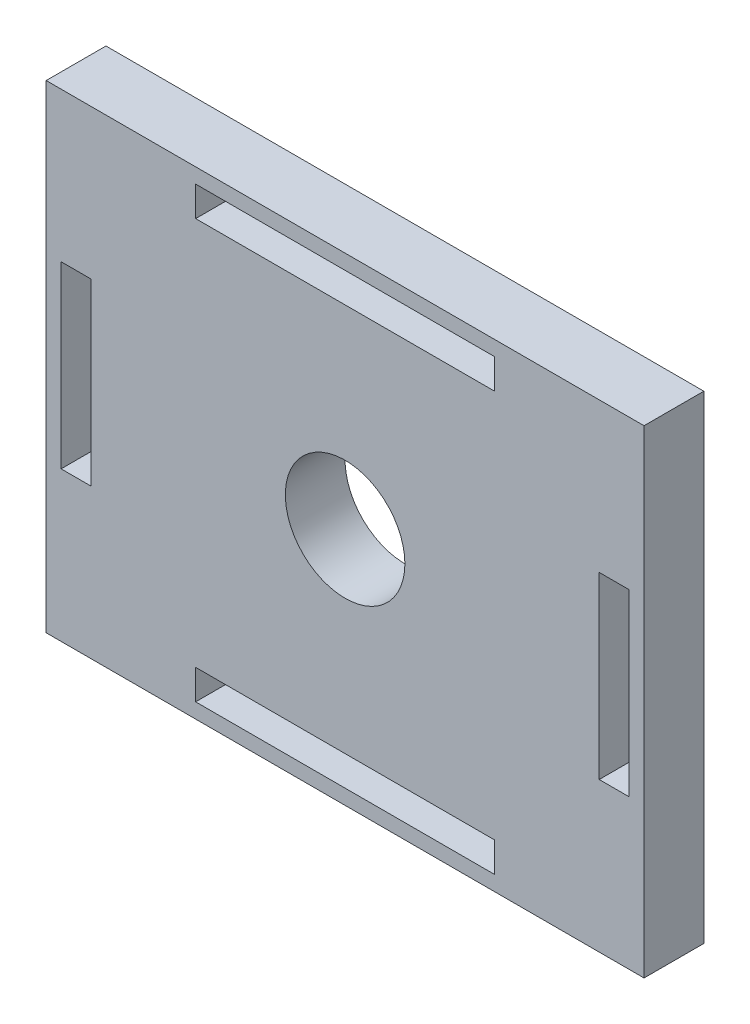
ISO-10303-21;
HEADER;
FILE_DESCRIPTION(('STEP AP214'),'2;1');
FILE_NAME('part.step','',(''),(''),'','','');
FILE_SCHEMA(('AUTOMOTIVE_DESIGN { 1 0 10303 214 1 1 1 1 }'));
ENDSEC;
DATA;
#1=APPLICATION_CONTEXT('core data for automotive mechanical design processes');
#2=APPLICATION_PROTOCOL_DEFINITION('international standard','automotive_design',2000,#1);
#3=PRODUCT_CONTEXT('',#1,'mechanical');
#4=PRODUCT('Part','Part','',(#3));
#5=PRODUCT_RELATED_PRODUCT_CATEGORY('part','',(#4));
#6=PRODUCT_DEFINITION_FORMATION('','',#4);
#7=PRODUCT_DEFINITION_CONTEXT('part definition',#1,'design');
#8=PRODUCT_DEFINITION('design','',#6,#7);
#9=PRODUCT_DEFINITION_SHAPE('','',#8);
#10=(LENGTH_UNIT() NAMED_UNIT(*) SI_UNIT(.MILLI.,.METRE.));
#11=(NAMED_UNIT(*) PLANE_ANGLE_UNIT() SI_UNIT($,.RADIAN.));
#12=(NAMED_UNIT(*) SI_UNIT($,.STERADIAN.) SOLID_ANGLE_UNIT());
#13=UNCERTAINTY_MEASURE_WITH_UNIT(LENGTH_MEASURE(1.E-05),#10,'distance_accuracy_value','');
#14=(GEOMETRIC_REPRESENTATION_CONTEXT(3) GLOBAL_UNCERTAINTY_ASSIGNED_CONTEXT((#13)) GLOBAL_UNIT_ASSIGNED_CONTEXT((#10,
#11,#12)) REPRESENTATION_CONTEXT('',''));
#15=CARTESIAN_POINT('',(0.,0.,0.));
#16=DIRECTION('',(0.,0.,1.));
#17=DIRECTION('',(1.,0.,0.));
#18=AXIS2_PLACEMENT_3D('',#15,#16,#17);
#19=CARTESIAN_POINT('',(0.,0.,10.));
#20=DIRECTION('',(0.,0.,-1.));
#21=DIRECTION('',(-1.,0.,0.));
#22=AXIS2_PLACEMENT_3D('',#19,#20,#21);
#23=PLANE('',#22);
#24=DIRECTION('',(0.,1.,0.));
#25=VECTOR('',#24,1.);
#26=CARTESIAN_POINT('',(-42.5,-15.,10.));
#27=LINE('',#26,#25);
#28=CARTESIAN_POINT('',(-42.5,-15.,10.));
#29=VERTEX_POINT('',#28);
#30=CARTESIAN_POINT('',(-42.5,15.,10.));
#31=VERTEX_POINT('',#30);
#32=EDGE_CURVE('E206',#29,#31,#27,.T.);
#33=ORIENTED_EDGE('',*,*,#32,.F.);
#34=DIRECTION('',(1.,0.,0.));
#35=VECTOR('',#34,1.);
#36=CARTESIAN_POINT('',(-47.5,-15.,10.));
#37=LINE('',#36,#35);
#38=CARTESIAN_POINT('',(-47.5,-15.,10.));
#39=VERTEX_POINT('',#38);
#40=EDGE_CURVE('E214',#39,#29,#37,.T.);
#41=ORIENTED_EDGE('',*,*,#40,.F.);
#42=DIRECTION('',(0.,-1.,0.));
#43=VECTOR('',#42,1.);
#44=CARTESIAN_POINT('',(-47.5,-15.,10.));
#45=LINE('',#44,#43);
#46=CARTESIAN_POINT('',(-47.5,15.,10.));
#47=VERTEX_POINT('',#46);
#48=EDGE_CURVE('E211',#47,#39,#45,.T.);
#49=ORIENTED_EDGE('',*,*,#48,.F.);
#50=DIRECTION('',(-1.,0.,0.));
#51=VECTOR('',#50,1.);
#52=CARTESIAN_POINT('',(-47.5,15.,10.));
#53=LINE('',#52,#51);
#54=EDGE_CURVE('E208',#31,#47,#53,.T.);
#55=ORIENTED_EDGE('',*,*,#54,.F.);
#56=EDGE_LOOP('',(#33,#41,#49,#55));
#57=FACE_BOUND('',#56,.T.);
#58=DIRECTION('',(0.,1.,0.));
#59=VECTOR('',#58,1.);
#60=CARTESIAN_POINT('',(25.,32.5,10.));
#61=LINE('',#60,#59);
#62=CARTESIAN_POINT('',(25.,32.5,10.));
#63=VERTEX_POINT('',#62);
#64=CARTESIAN_POINT('',(25.,37.5,10.));
#65=VERTEX_POINT('',#64);
#66=EDGE_CURVE('E274',#63,#65,#61,.T.);
#67=ORIENTED_EDGE('',*,*,#66,.F.);
#68=DIRECTION('',(1.,0.,0.));
#69=VECTOR('',#68,1.);
#70=CARTESIAN_POINT('',(-25.,32.5,10.));
#71=LINE('',#70,#69);
#72=CARTESIAN_POINT('',(-25.,32.5,10.));
#73=VERTEX_POINT('',#72);
#74=EDGE_CURVE('E282',#73,#63,#71,.T.);
#75=ORIENTED_EDGE('',*,*,#74,.F.);
#76=DIRECTION('',(0.,-1.,0.));
#77=VECTOR('',#76,1.);
#78=CARTESIAN_POINT('',(-25.,32.5,10.));
#79=LINE('',#78,#77);
#80=CARTESIAN_POINT('',(-25.,37.5,10.));
#81=VERTEX_POINT('',#80);
#82=EDGE_CURVE('E279',#81,#73,#79,.T.);
#83=ORIENTED_EDGE('',*,*,#82,.F.);
#84=DIRECTION('',(-1.,0.,0.));
#85=VECTOR('',#84,1.);
#86=CARTESIAN_POINT('',(-25.,37.5,10.));
#87=LINE('',#86,#85);
#88=EDGE_CURVE('E276',#65,#81,#87,.T.);
#89=ORIENTED_EDGE('',*,*,#88,.F.);
#90=EDGE_LOOP('',(#67,#75,#83,#89));
#91=FACE_BOUND('',#90,.T.);
#92=DIRECTION('',(0.,1.,0.));
#93=VECTOR('',#92,1.);
#94=CARTESIAN_POINT('',(50.,-40.,10.));
#95=LINE('',#94,#93);
#96=CARTESIAN_POINT('',(50.,-40.,10.));
#97=VERTEX_POINT('',#96);
#98=CARTESIAN_POINT('',(50.,40.,10.));
#99=VERTEX_POINT('',#98);
#100=EDGE_CURVE('E305',#97,#99,#95,.T.);
#101=ORIENTED_EDGE('',*,*,#100,.T.);
#102=DIRECTION('',(-1.,0.,0.));
#103=VECTOR('',#102,1.);
#104=CARTESIAN_POINT('',(-50.,40.,10.));
#105=LINE('',#104,#103);
#106=CARTESIAN_POINT('',(-50.,40.,10.));
#107=VERTEX_POINT('',#106);
#108=EDGE_CURVE('E308',#99,#107,#105,.T.);
#109=ORIENTED_EDGE('',*,*,#108,.T.);
#110=DIRECTION('',(0.,-1.,0.));
#111=VECTOR('',#110,1.);
#112=CARTESIAN_POINT('',(-50.,-40.,10.));
#113=LINE('',#112,#111);
#114=CARTESIAN_POINT('',(-50.,-40.,10.));
#115=VERTEX_POINT('',#114);
#116=EDGE_CURVE('E311',#107,#115,#113,.T.);
#117=ORIENTED_EDGE('',*,*,#116,.T.);
#118=DIRECTION('',(1.,0.,0.));
#119=VECTOR('',#118,1.);
#120=CARTESIAN_POINT('',(-50.,-40.,10.));
#121=LINE('',#120,#119);
#122=EDGE_CURVE('E313',#115,#97,#121,.T.);
#123=ORIENTED_EDGE('',*,*,#122,.T.);
#124=EDGE_LOOP('',(#101,#109,#117,#123));
#125=FACE_BOUND('',#124,.T.);
#126=DIRECTION('',(-1.,0.,0.));
#127=VECTOR('',#126,1.);
#128=CARTESIAN_POINT('',(-25.,-32.5,10.));
#129=LINE('',#128,#127);
#130=CARTESIAN_POINT('',(25.,-32.5,10.));
#131=VERTEX_POINT('',#130);
#132=CARTESIAN_POINT('',(-25.,-32.5,10.));
#133=VERTEX_POINT('',#132);
#134=EDGE_CURVE('E243',#131,#133,#129,.T.);
#135=ORIENTED_EDGE('',*,*,#134,.F.);
#136=DIRECTION('',(0.,1.,0.));
#137=VECTOR('',#136,1.);
#138=CARTESIAN_POINT('',(25.,-32.5,10.));
#139=LINE('',#138,#137);
#140=CARTESIAN_POINT('',(25.,-37.5,10.));
#141=VERTEX_POINT('',#140);
#142=EDGE_CURVE('E251',#141,#131,#139,.T.);
#143=ORIENTED_EDGE('',*,*,#142,.F.);
#144=DIRECTION('',(1.,0.,0.));
#145=VECTOR('',#144,1.);
#146=CARTESIAN_POINT('',(-25.,-37.5,10.));
#147=LINE('',#146,#145);
#148=CARTESIAN_POINT('',(-25.,-37.5,10.));
#149=VERTEX_POINT('',#148);
#150=EDGE_CURVE('E248',#149,#141,#147,.T.);
#151=ORIENTED_EDGE('',*,*,#150,.F.);
#152=DIRECTION('',(0.,-1.,0.));
#153=VECTOR('',#152,1.);
#154=CARTESIAN_POINT('',(-25.,-32.5,10.));
#155=LINE('',#154,#153);
#156=EDGE_CURVE('E245',#133,#149,#155,.T.);
#157=ORIENTED_EDGE('',*,*,#156,.F.);
#158=EDGE_LOOP('',(#135,#143,#151,#157));
#159=FACE_BOUND('',#158,.T.);
#160=CARTESIAN_POINT('',(0.,0.,10.));
#161=DIRECTION('',(0.,0.,1.));
#162=DIRECTION('',(1.,0.,0.));
#163=AXIS2_PLACEMENT_3D('',#160,#161,#162);
#164=CIRCLE('',#163,10.);
#165=CARTESIAN_POINT('',(10.,0.,10.));
#166=VERTEX_POINT('',#165);
#167=EDGE_CURVE('E237',#166,#166,#164,.T.);
#168=ORIENTED_EDGE('',*,*,#167,.F.);
#169=EDGE_LOOP('',(#168));
#170=FACE_BOUND('',#169,.T.);
#171=DIRECTION('',(0.,1.,0.));
#172=VECTOR('',#171,1.);
#173=CARTESIAN_POINT('',(47.5,-15.,10.));
#174=LINE('',#173,#172);
#175=CARTESIAN_POINT('',(47.5,-15.,10.));
#176=VERTEX_POINT('',#175);
#177=CARTESIAN_POINT('',(47.5,15.,10.));
#178=VERTEX_POINT('',#177);
#179=EDGE_CURVE('E170',#176,#178,#174,.T.);
#180=ORIENTED_EDGE('',*,*,#179,.F.);
#181=DIRECTION('',(1.,0.,0.));
#182=VECTOR('',#181,1.);
#183=CARTESIAN_POINT('',(47.5,-15.,10.));
#184=LINE('',#183,#182);
#185=CARTESIAN_POINT('',(42.5,-15.,10.));
#186=VERTEX_POINT('',#185);
#187=EDGE_CURVE('E192',#186,#176,#184,.T.);
#188=ORIENTED_EDGE('',*,*,#187,.F.);
#189=DIRECTION('',(0.,-1.,0.));
#190=VECTOR('',#189,1.);
#191=CARTESIAN_POINT('',(42.5,-15.,10.));
#192=LINE('',#191,#190);
#193=CARTESIAN_POINT('',(42.5,15.,10.));
#194=VERTEX_POINT('',#193);
#195=EDGE_CURVE('E190',#194,#186,#192,.T.);
#196=ORIENTED_EDGE('',*,*,#195,.F.);
#197=DIRECTION('',(-1.,0.,0.));
#198=VECTOR('',#197,1.);
#199=CARTESIAN_POINT('',(47.5,15.,10.));
#200=LINE('',#199,#198);
#201=EDGE_CURVE('E178',#178,#194,#200,.T.);
#202=ORIENTED_EDGE('',*,*,#201,.F.);
#203=EDGE_LOOP('',(#180,#188,#196,#202));
#204=FACE_BOUND('',#203,.T.);
#205=ADVANCED_FACE('F33',(#57,#91,#125,#159,#170,#204),#23,.F.);
#206=CARTESIAN_POINT('',(0.,0.,0.));
#207=DIRECTION('',(0.,0.,-1.));
#208=DIRECTION('',(-1.,0.,0.));
#209=AXIS2_PLACEMENT_3D('',#206,#207,#208);
#210=PLANE('',#209);
#211=DIRECTION('',(0.,1.,0.));
#212=VECTOR('',#211,1.);
#213=CARTESIAN_POINT('',(25.,-32.5,0.));
#214=LINE('',#213,#212);
#215=CARTESIAN_POINT('',(25.,-37.5,0.));
#216=VERTEX_POINT('',#215);
#217=CARTESIAN_POINT('',(25.,-32.5,0.));
#218=VERTEX_POINT('',#217);
#219=EDGE_CURVE('E246',#216,#218,#214,.T.);
#220=ORIENTED_EDGE('',*,*,#219,.T.);
#221=DIRECTION('',(-1.,0.,0.));
#222=VECTOR('',#221,1.);
#223=CARTESIAN_POINT('',(-25.,-32.5,0.));
#224=LINE('',#223,#222);
#225=CARTESIAN_POINT('',(-25.,-32.5,0.));
#226=VERTEX_POINT('',#225);
#227=EDGE_CURVE('E240',#218,#226,#224,.T.);
#228=ORIENTED_EDGE('',*,*,#227,.T.);
#229=DIRECTION('',(0.,-1.,0.));
#230=VECTOR('',#229,1.);
#231=CARTESIAN_POINT('',(-25.,-32.5,0.));
#232=LINE('',#231,#230);
#233=CARTESIAN_POINT('',(-25.,-37.5,0.));
#234=VERTEX_POINT('',#233);
#235=EDGE_CURVE('E256',#226,#234,#232,.T.);
#236=ORIENTED_EDGE('',*,*,#235,.T.);
#237=DIRECTION('',(1.,0.,0.));
#238=VECTOR('',#237,1.);
#239=CARTESIAN_POINT('',(-25.,-37.5,0.));
#240=LINE('',#239,#238);
#241=EDGE_CURVE('E259',#234,#216,#240,.T.);
#242=ORIENTED_EDGE('',*,*,#241,.T.);
#243=EDGE_LOOP('',(#220,#228,#236,#242));
#244=FACE_BOUND('',#243,.T.);
#245=DIRECTION('',(1.,0.,0.));
#246=VECTOR('',#245,1.);
#247=CARTESIAN_POINT('',(-25.,32.5,0.));
#248=LINE('',#247,#246);
#249=CARTESIAN_POINT('',(-25.,32.5,0.));
#250=VERTEX_POINT('',#249);
#251=CARTESIAN_POINT('',(25.,32.5,0.));
#252=VERTEX_POINT('',#251);
#253=EDGE_CURVE('E277',#250,#252,#248,.T.);
#254=ORIENTED_EDGE('',*,*,#253,.T.);
#255=DIRECTION('',(0.,1.,0.));
#256=VECTOR('',#255,1.);
#257=CARTESIAN_POINT('',(25.,32.5,0.));
#258=LINE('',#257,#256);
#259=CARTESIAN_POINT('',(25.,37.5,0.));
#260=VERTEX_POINT('',#259);
#261=EDGE_CURVE('E273',#252,#260,#258,.T.);
#262=ORIENTED_EDGE('',*,*,#261,.T.);
#263=DIRECTION('',(-1.,0.,0.));
#264=VECTOR('',#263,1.);
#265=CARTESIAN_POINT('',(-25.,37.5,0.));
#266=LINE('',#265,#264);
#267=CARTESIAN_POINT('',(-25.,37.5,0.));
#268=VERTEX_POINT('',#267);
#269=EDGE_CURVE('E287',#260,#268,#266,.T.);
#270=ORIENTED_EDGE('',*,*,#269,.T.);
#271=DIRECTION('',(0.,-1.,0.));
#272=VECTOR('',#271,1.);
#273=CARTESIAN_POINT('',(-25.,32.5,0.));
#274=LINE('',#273,#272);
#275=EDGE_CURVE('E290',#268,#250,#274,.T.);
#276=ORIENTED_EDGE('',*,*,#275,.T.);
#277=EDGE_LOOP('',(#254,#262,#270,#276));
#278=FACE_BOUND('',#277,.T.);
#279=DIRECTION('',(0.,1.,0.));
#280=VECTOR('',#279,1.);
#281=CARTESIAN_POINT('',(50.,-40.,0.));
#282=LINE('',#281,#280);
#283=CARTESIAN_POINT('',(50.,-40.,0.));
#284=VERTEX_POINT('',#283);
#285=CARTESIAN_POINT('',(50.,40.,0.));
#286=VERTEX_POINT('',#285);
#287=EDGE_CURVE('E304',#284,#286,#282,.T.);
#288=ORIENTED_EDGE('',*,*,#287,.F.);
#289=DIRECTION('',(1.,0.,0.));
#290=VECTOR('',#289,1.);
#291=CARTESIAN_POINT('',(-50.,-40.,0.));
#292=LINE('',#291,#290);
#293=CARTESIAN_POINT('',(-50.,-40.,0.));
#294=VERTEX_POINT('',#293);
#295=EDGE_CURVE('E309',#294,#284,#292,.T.);
#296=ORIENTED_EDGE('',*,*,#295,.F.);
#297=DIRECTION('',(0.,-1.,0.));
#298=VECTOR('',#297,1.);
#299=CARTESIAN_POINT('',(-50.,-40.,0.));
#300=LINE('',#299,#298);
#301=CARTESIAN_POINT('',(-50.,40.,0.));
#302=VERTEX_POINT('',#301);
#303=EDGE_CURVE('E320',#302,#294,#300,.T.);
#304=ORIENTED_EDGE('',*,*,#303,.F.);
#305=DIRECTION('',(-1.,0.,0.));
#306=VECTOR('',#305,1.);
#307=CARTESIAN_POINT('',(-50.,40.,0.));
#308=LINE('',#307,#306);
#309=EDGE_CURVE('E318',#286,#302,#308,.T.);
#310=ORIENTED_EDGE('',*,*,#309,.F.);
#311=EDGE_LOOP('',(#288,#296,#304,#310));
#312=FACE_BOUND('',#311,.T.);
#313=CARTESIAN_POINT('',(0.,0.,0.));
#314=DIRECTION('',(0.,0.,1.));
#315=DIRECTION('',(1.,0.,0.));
#316=AXIS2_PLACEMENT_3D('',#313,#314,#315);
#317=CIRCLE('',#316,10.);
#318=CARTESIAN_POINT('',(10.,0.,0.));
#319=VERTEX_POINT('',#318);
#320=EDGE_CURVE('E236',#319,#319,#317,.T.);
#321=ORIENTED_EDGE('',*,*,#320,.T.);
#322=EDGE_LOOP('',(#321));
#323=FACE_BOUND('',#322,.T.);
#324=DIRECTION('',(1.,0.,0.));
#325=VECTOR('',#324,1.);
#326=CARTESIAN_POINT('',(-47.5,-15.,0.));
#327=LINE('',#326,#325);
#328=CARTESIAN_POINT('',(-47.5,-15.,0.));
#329=VERTEX_POINT('',#328);
#330=CARTESIAN_POINT('',(-42.5,-15.,0.));
#331=VERTEX_POINT('',#330);
#332=EDGE_CURVE('E209',#329,#331,#327,.T.);
#333=ORIENTED_EDGE('',*,*,#332,.T.);
#334=DIRECTION('',(0.,1.,0.));
#335=VECTOR('',#334,1.);
#336=CARTESIAN_POINT('',(-42.5,-15.,0.));
#337=LINE('',#336,#335);
#338=CARTESIAN_POINT('',(-42.5,15.,0.));
#339=VERTEX_POINT('',#338);
#340=EDGE_CURVE('E186',#331,#339,#337,.T.);
#341=ORIENTED_EDGE('',*,*,#340,.T.);
#342=DIRECTION('',(-1.,0.,0.));
#343=VECTOR('',#342,1.);
#344=CARTESIAN_POINT('',(-47.5,15.,0.));
#345=LINE('',#344,#343);
#346=CARTESIAN_POINT('',(-47.5,15.,0.));
#347=VERTEX_POINT('',#346);
#348=EDGE_CURVE('E219',#339,#347,#345,.T.);
#349=ORIENTED_EDGE('',*,*,#348,.T.);
#350=DIRECTION('',(0.,-1.,0.));
#351=VECTOR('',#350,1.);
#352=CARTESIAN_POINT('',(-47.5,-15.,0.));
#353=LINE('',#352,#351);
#354=EDGE_CURVE('E222',#347,#329,#353,.T.);
#355=ORIENTED_EDGE('',*,*,#354,.T.);
#356=EDGE_LOOP('',(#333,#341,#349,#355));
#357=FACE_BOUND('',#356,.T.);
#358=DIRECTION('',(1.,0.,0.));
#359=VECTOR('',#358,1.);
#360=CARTESIAN_POINT('',(47.5,-15.,0.));
#361=LINE('',#360,#359);
#362=CARTESIAN_POINT('',(42.5,-15.,0.));
#363=VERTEX_POINT('',#362);
#364=CARTESIAN_POINT('',(47.5,-15.,0.));
#365=VERTEX_POINT('',#364);
#366=EDGE_CURVE('E179',#363,#365,#361,.T.);
#367=ORIENTED_EDGE('',*,*,#366,.T.);
#368=DIRECTION('',(0.,1.,0.));
#369=VECTOR('',#368,1.);
#370=CARTESIAN_POINT('',(47.5,-15.,0.));
#371=LINE('',#370,#369);
#372=CARTESIAN_POINT('',(47.5,15.,0.));
#373=VERTEX_POINT('',#372);
#374=EDGE_CURVE('E56',#365,#373,#371,.T.);
#375=ORIENTED_EDGE('',*,*,#374,.T.);
#376=DIRECTION('',(-1.,0.,0.));
#377=VECTOR('',#376,1.);
#378=CARTESIAN_POINT('',(47.5,15.,0.));
#379=LINE('',#378,#377);
#380=CARTESIAN_POINT('',(42.5,15.,0.));
#381=VERTEX_POINT('',#380);
#382=EDGE_CURVE('E185',#373,#381,#379,.T.);
#383=ORIENTED_EDGE('',*,*,#382,.T.);
#384=DIRECTION('',(0.,-1.,0.));
#385=VECTOR('',#384,1.);
#386=CARTESIAN_POINT('',(42.5,-15.,0.));
#387=LINE('',#386,#385);
#388=EDGE_CURVE('E198',#381,#363,#387,.T.);
#389=ORIENTED_EDGE('',*,*,#388,.T.);
#390=EDGE_LOOP('',(#367,#375,#383,#389));
#391=FACE_BOUND('',#390,.T.);
#392=ADVANCED_FACE('F338',(#244,#278,#312,#323,#357,#391),#210,.T.);
#393=CARTESIAN_POINT('',(50.,-40.,10.));
#394=DIRECTION('',(-1.,0.,0.));
#395=DIRECTION('',(0.,0.,1.));
#396=AXIS2_PLACEMENT_3D('',#393,#394,#395);
#397=PLANE('',#396);
#398=ORIENTED_EDGE('',*,*,#287,.T.);
#399=DIRECTION('',(0.,0.,-1.));
#400=VECTOR('',#399,1.);
#401=CARTESIAN_POINT('',(50.,40.,10.));
#402=LINE('',#401,#400);
#403=EDGE_CURVE('E11',#99,#286,#402,.T.);
#404=ORIENTED_EDGE('',*,*,#403,.F.);
#405=ORIENTED_EDGE('',*,*,#100,.F.);
#406=DIRECTION('',(0.,0.,-1.));
#407=VECTOR('',#406,1.);
#408=CARTESIAN_POINT('',(50.,-40.,10.));
#409=LINE('',#408,#407);
#410=EDGE_CURVE('E315',#97,#284,#409,.T.);
#411=ORIENTED_EDGE('',*,*,#410,.T.);
#412=EDGE_LOOP('',(#398,#404,#405,#411));
#413=FACE_BOUND('',#412,.T.);
#414=ADVANCED_FACE('F35',(#413),#397,.F.);
#415=CARTESIAN_POINT('',(-50.,40.,10.));
#416=DIRECTION('',(0.,-1.,0.));
#417=DIRECTION('',(0.,0.,-1.));
#418=AXIS2_PLACEMENT_3D('',#415,#416,#417);
#419=PLANE('',#418);
#420=ORIENTED_EDGE('',*,*,#309,.T.);
#421=DIRECTION('',(0.,0.,-1.));
#422=VECTOR('',#421,1.);
#423=CARTESIAN_POINT('',(-50.,40.,10.));
#424=LINE('',#423,#422);
#425=EDGE_CURVE('E41',#107,#302,#424,.T.);
#426=ORIENTED_EDGE('',*,*,#425,.F.);
#427=ORIENTED_EDGE('',*,*,#108,.F.);
#428=ORIENTED_EDGE('',*,*,#403,.T.);
#429=EDGE_LOOP('',(#420,#426,#427,#428));
#430=FACE_BOUND('',#429,.T.);
#431=ADVANCED_FACE('F349',(#430),#419,.F.);
#432=CARTESIAN_POINT('',(-50.,-40.,10.));
#433=DIRECTION('',(1.,0.,0.));
#434=DIRECTION('',(0.,0.,-1.));
#435=AXIS2_PLACEMENT_3D('',#432,#433,#434);
#436=PLANE('',#435);
#437=ORIENTED_EDGE('',*,*,#303,.T.);
#438=DIRECTION('',(0.,0.,-1.));
#439=VECTOR('',#438,1.);
#440=CARTESIAN_POINT('',(-50.,-40.,10.));
#441=LINE('',#440,#439);
#442=EDGE_CURVE('E325',#115,#294,#441,.T.);
#443=ORIENTED_EDGE('',*,*,#442,.F.);
#444=ORIENTED_EDGE('',*,*,#116,.F.);
#445=ORIENTED_EDGE('',*,*,#425,.T.);
#446=EDGE_LOOP('',(#437,#443,#444,#445));
#447=FACE_BOUND('',#446,.T.);
#448=ADVANCED_FACE('F332',(#447),#436,.F.);
#449=CARTESIAN_POINT('',(-50.,-40.,10.));
#450=DIRECTION('',(0.,1.,0.));
#451=DIRECTION('',(0.,0.,1.));
#452=AXIS2_PLACEMENT_3D('',#449,#450,#451);
#453=PLANE('',#452);
#454=ORIENTED_EDGE('',*,*,#295,.T.);
#455=ORIENTED_EDGE('',*,*,#410,.F.);
#456=ORIENTED_EDGE('',*,*,#122,.F.);
#457=ORIENTED_EDGE('',*,*,#442,.T.);
#458=EDGE_LOOP('',(#454,#455,#456,#457));
#459=FACE_BOUND('',#458,.T.);
#460=ADVANCED_FACE('F342',(#459),#453,.F.);
#461=CARTESIAN_POINT('',(25.,32.5,10.));
#462=DIRECTION('',(-1.,0.,0.));
#463=DIRECTION('',(0.,-1.,0.));
#464=AXIS2_PLACEMENT_3D('',#461,#462,#463);
#465=PLANE('',#464);
#466=ORIENTED_EDGE('',*,*,#261,.F.);
#467=DIRECTION('',(0.,0.,-1.));
#468=VECTOR('',#467,1.);
#469=CARTESIAN_POINT('',(25.,32.5,10.));
#470=LINE('',#469,#468);
#471=EDGE_CURVE('E284',#63,#252,#470,.T.);
#472=ORIENTED_EDGE('',*,*,#471,.F.);
#473=ORIENTED_EDGE('',*,*,#66,.T.);
#474=DIRECTION('',(0.,0.,-1.));
#475=VECTOR('',#474,1.);
#476=CARTESIAN_POINT('',(25.,37.5,10.));
#477=LINE('',#476,#475);
#478=EDGE_CURVE('E301',#65,#260,#477,.T.);
#479=ORIENTED_EDGE('',*,*,#478,.T.);
#480=EDGE_LOOP('',(#466,#472,#473,#479));
#481=FACE_BOUND('',#480,.T.);
#482=ADVANCED_FACE('F367',(#481),#465,.T.);
#483=CARTESIAN_POINT('',(-25.,37.5,10.));
#484=DIRECTION('',(0.,-1.,0.));
#485=DIRECTION('',(1.,0.,0.));
#486=AXIS2_PLACEMENT_3D('',#483,#484,#485);
#487=PLANE('',#486);
#488=ORIENTED_EDGE('',*,*,#269,.F.);
#489=ORIENTED_EDGE('',*,*,#478,.F.);
#490=ORIENTED_EDGE('',*,*,#88,.T.);
#491=DIRECTION('',(0.,0.,-1.));
#492=VECTOR('',#491,1.);
#493=CARTESIAN_POINT('',(-25.,37.5,10.));
#494=LINE('',#493,#492);
#495=EDGE_CURVE('E299',#81,#268,#494,.T.);
#496=ORIENTED_EDGE('',*,*,#495,.T.);
#497=EDGE_LOOP('',(#488,#489,#490,#496));
#498=FACE_BOUND('',#497,.T.);
#499=ADVANCED_FACE('F374',(#498),#487,.T.);
#500=CARTESIAN_POINT('',(-25.,32.5,10.));
#501=DIRECTION('',(1.,0.,0.));
#502=DIRECTION('',(0.,0.,-1.));
#503=AXIS2_PLACEMENT_3D('',#500,#501,#502);
#504=PLANE('',#503);
#505=ORIENTED_EDGE('',*,*,#275,.F.);
#506=ORIENTED_EDGE('',*,*,#495,.F.);
#507=ORIENTED_EDGE('',*,*,#82,.T.);
#508=DIRECTION('',(0.,0.,-1.));
#509=VECTOR('',#508,1.);
#510=CARTESIAN_POINT('',(-25.,32.5,10.));
#511=LINE('',#510,#509);
#512=EDGE_CURVE('E297',#73,#250,#511,.T.);
#513=ORIENTED_EDGE('',*,*,#512,.T.);
#514=EDGE_LOOP('',(#505,#506,#507,#513));
#515=FACE_BOUND('',#514,.T.);
#516=ADVANCED_FACE('F379',(#515),#504,.T.);
#517=CARTESIAN_POINT('',(-25.,32.5,10.));
#518=DIRECTION('',(0.,1.,0.));
#519=DIRECTION('',(-1.,0.,0.));
#520=AXIS2_PLACEMENT_3D('',#517,#518,#519);
#521=PLANE('',#520);
#522=ORIENTED_EDGE('',*,*,#253,.F.);
#523=ORIENTED_EDGE('',*,*,#512,.F.);
#524=ORIENTED_EDGE('',*,*,#74,.T.);
#525=ORIENTED_EDGE('',*,*,#471,.T.);
#526=EDGE_LOOP('',(#522,#523,#524,#525));
#527=FACE_BOUND('',#526,.T.);
#528=ADVANCED_FACE('F387',(#527),#521,.T.);
#529=CARTESIAN_POINT('',(-25.,-32.5,10.));
#530=DIRECTION('',(0.,-1.,0.));
#531=DIRECTION('',(1.,0.,0.));
#532=AXIS2_PLACEMENT_3D('',#529,#530,#531);
#533=PLANE('',#532);
#534=ORIENTED_EDGE('',*,*,#227,.F.);
#535=DIRECTION('',(0.,0.,-1.));
#536=VECTOR('',#535,1.);
#537=CARTESIAN_POINT('',(25.,-32.5,10.));
#538=LINE('',#537,#536);
#539=EDGE_CURVE('E253',#131,#218,#538,.T.);
#540=ORIENTED_EDGE('',*,*,#539,.F.);
#541=ORIENTED_EDGE('',*,*,#134,.T.);
#542=DIRECTION('',(0.,0.,-1.));
#543=VECTOR('',#542,1.);
#544=CARTESIAN_POINT('',(-25.,-32.5,10.));
#545=LINE('',#544,#543);
#546=EDGE_CURVE('E270',#133,#226,#545,.T.);
#547=ORIENTED_EDGE('',*,*,#546,.T.);
#548=EDGE_LOOP('',(#534,#540,#541,#547));
#549=FACE_BOUND('',#548,.T.);
#550=ADVANCED_FACE('F399',(#549),#533,.T.);
#551=CARTESIAN_POINT('',(-25.,-32.5,10.));
#552=DIRECTION('',(1.,0.,0.));
#553=DIRECTION('',(0.,0.,-1.));
#554=AXIS2_PLACEMENT_3D('',#551,#552,#553);
#555=PLANE('',#554);
#556=ORIENTED_EDGE('',*,*,#235,.F.);
#557=ORIENTED_EDGE('',*,*,#546,.F.);
#558=ORIENTED_EDGE('',*,*,#156,.T.);
#559=DIRECTION('',(0.,0.,-1.));
#560=VECTOR('',#559,1.);
#561=CARTESIAN_POINT('',(-25.,-37.5,10.));
#562=LINE('',#561,#560);
#563=EDGE_CURVE('E268',#149,#234,#562,.T.);
#564=ORIENTED_EDGE('',*,*,#563,.T.);
#565=EDGE_LOOP('',(#556,#557,#558,#564));
#566=FACE_BOUND('',#565,.T.);
#567=ADVANCED_FACE('F404',(#566),#555,.T.);
#568=CARTESIAN_POINT('',(-25.,-37.5,10.));
#569=DIRECTION('',(0.,1.,0.));
#570=DIRECTION('',(-1.,0.,0.));
#571=AXIS2_PLACEMENT_3D('',#568,#569,#570);
#572=PLANE('',#571);
#573=ORIENTED_EDGE('',*,*,#241,.F.);
#574=ORIENTED_EDGE('',*,*,#563,.F.);
#575=ORIENTED_EDGE('',*,*,#150,.T.);
#576=DIRECTION('',(0.,0.,-1.));
#577=VECTOR('',#576,1.);
#578=CARTESIAN_POINT('',(25.,-37.5,10.));
#579=LINE('',#578,#577);
#580=EDGE_CURVE('E266',#141,#216,#579,.T.);
#581=ORIENTED_EDGE('',*,*,#580,.T.);
#582=EDGE_LOOP('',(#573,#574,#575,#581));
#583=FACE_BOUND('',#582,.T.);
#584=ADVANCED_FACE('F408',(#583),#572,.T.);
#585=CARTESIAN_POINT('',(25.,-32.5,10.));
#586=DIRECTION('',(-1.,0.,0.));
#587=DIRECTION('',(0.,-1.,0.));
#588=AXIS2_PLACEMENT_3D('',#585,#586,#587);
#589=PLANE('',#588);
#590=ORIENTED_EDGE('',*,*,#219,.F.);
#591=ORIENTED_EDGE('',*,*,#580,.F.);
#592=ORIENTED_EDGE('',*,*,#142,.T.);
#593=ORIENTED_EDGE('',*,*,#539,.T.);
#594=EDGE_LOOP('',(#590,#591,#592,#593));
#595=FACE_BOUND('',#594,.T.);
#596=ADVANCED_FACE('F412',(#595),#589,.T.);
#597=CARTESIAN_POINT('',(0.,0.,10.));
#598=DIRECTION('',(0.,0.,-1.));
#599=DIRECTION('',(-1.,0.,0.));
#600=AXIS2_PLACEMENT_3D('',#597,#598,#599);
#601=CYLINDRICAL_SURFACE('',#600,10.);
#602=ORIENTED_EDGE('',*,*,#167,.T.);
#603=EDGE_LOOP('',(#602));
#604=FACE_BOUND('',#603,.T.);
#605=ORIENTED_EDGE('',*,*,#320,.F.);
#606=EDGE_LOOP('',(#605));
#607=FACE_BOUND('',#606,.T.);
#608=ADVANCED_FACE('F416',(#604,#607),#601,.F.);
#609=CARTESIAN_POINT('',(-42.5,-15.,10.));
#610=DIRECTION('',(-1.,0.,0.));
#611=DIRECTION('',(0.,0.,1.));
#612=AXIS2_PLACEMENT_3D('',#609,#610,#611);
#613=PLANE('',#612);
#614=ORIENTED_EDGE('',*,*,#340,.F.);
#615=DIRECTION('',(0.,0.,-1.));
#616=VECTOR('',#615,1.);
#617=CARTESIAN_POINT('',(-42.5,-15.,10.));
#618=LINE('',#617,#616);
#619=EDGE_CURVE('E216',#29,#331,#618,.T.);
#620=ORIENTED_EDGE('',*,*,#619,.F.);
#621=ORIENTED_EDGE('',*,*,#32,.T.);
#622=DIRECTION('',(0.,0.,-1.));
#623=VECTOR('',#622,1.);
#624=CARTESIAN_POINT('',(-42.5,15.,10.));
#625=LINE('',#624,#623);
#626=EDGE_CURVE('E233',#31,#339,#625,.T.);
#627=ORIENTED_EDGE('',*,*,#626,.T.);
#628=EDGE_LOOP('',(#614,#620,#621,#627));
#629=FACE_BOUND('',#628,.T.);
#630=ADVANCED_FACE('F420',(#629),#613,.T.);
#631=CARTESIAN_POINT('',(-47.5,15.,10.));
#632=DIRECTION('',(0.,-1.,0.));
#633=DIRECTION('',(0.,0.,-1.));
#634=AXIS2_PLACEMENT_3D('',#631,#632,#633);
#635=PLANE('',#634);
#636=ORIENTED_EDGE('',*,*,#348,.F.);
#637=ORIENTED_EDGE('',*,*,#626,.F.);
#638=ORIENTED_EDGE('',*,*,#54,.T.);
#639=DIRECTION('',(0.,0.,-1.));
#640=VECTOR('',#639,1.);
#641=CARTESIAN_POINT('',(-47.5,15.,10.));
#642=LINE('',#641,#640);
#643=EDGE_CURVE('E231',#47,#347,#642,.T.);
#644=ORIENTED_EDGE('',*,*,#643,.T.);
#645=EDGE_LOOP('',(#636,#637,#638,#644));
#646=FACE_BOUND('',#645,.T.);
#647=ADVANCED_FACE('F424',(#646),#635,.T.);
#648=CARTESIAN_POINT('',(-47.5,-15.,10.));
#649=DIRECTION('',(1.,0.,0.));
#650=DIRECTION('',(0.,0.,-1.));
#651=AXIS2_PLACEMENT_3D('',#648,#649,#650);
#652=PLANE('',#651);
#653=ORIENTED_EDGE('',*,*,#354,.F.);
#654=ORIENTED_EDGE('',*,*,#643,.F.);
#655=ORIENTED_EDGE('',*,*,#48,.T.);
#656=DIRECTION('',(0.,0.,-1.));
#657=VECTOR('',#656,1.);
#658=CARTESIAN_POINT('',(-47.5,-15.,10.));
#659=LINE('',#658,#657);
#660=EDGE_CURVE('E229',#39,#329,#659,.T.);
#661=ORIENTED_EDGE('',*,*,#660,.T.);
#662=EDGE_LOOP('',(#653,#654,#655,#661));
#663=FACE_BOUND('',#662,.T.);
#664=ADVANCED_FACE('F428',(#663),#652,.T.);
#665=CARTESIAN_POINT('',(-47.5,-15.,10.));
#666=DIRECTION('',(0.,1.,0.));
#667=DIRECTION('',(-1.,0.,0.));
#668=AXIS2_PLACEMENT_3D('',#665,#666,#667);
#669=PLANE('',#668);
#670=ORIENTED_EDGE('',*,*,#332,.F.);
#671=ORIENTED_EDGE('',*,*,#660,.F.);
#672=ORIENTED_EDGE('',*,*,#40,.T.);
#673=ORIENTED_EDGE('',*,*,#619,.T.);
#674=EDGE_LOOP('',(#670,#671,#672,#673));
#675=FACE_BOUND('',#674,.T.);
#676=ADVANCED_FACE('F432',(#675),#669,.T.);
#677=CARTESIAN_POINT('',(47.5,-15.,10.));
#678=DIRECTION('',(-1.,0.,0.));
#679=DIRECTION('',(0.,0.,1.));
#680=AXIS2_PLACEMENT_3D('',#677,#678,#679);
#681=PLANE('',#680);
#682=ORIENTED_EDGE('',*,*,#374,.F.);
#683=DIRECTION('',(0.,0.,-1.));
#684=VECTOR('',#683,1.);
#685=CARTESIAN_POINT('',(47.5,-15.,10.));
#686=LINE('',#685,#684);
#687=EDGE_CURVE('E174',#176,#365,#686,.T.);
#688=ORIENTED_EDGE('',*,*,#687,.F.);
#689=ORIENTED_EDGE('',*,*,#179,.T.);
#690=DIRECTION('',(0.,0.,-1.));
#691=VECTOR('',#690,1.);
#692=CARTESIAN_POINT('',(47.5,15.,10.));
#693=LINE('',#692,#691);
#694=EDGE_CURVE('E173',#178,#373,#693,.T.);
#695=ORIENTED_EDGE('',*,*,#694,.T.);
#696=EDGE_LOOP('',(#682,#688,#689,#695));
#697=FACE_BOUND('',#696,.T.);
#698=ADVANCED_FACE('F172',(#697),#681,.T.);
#699=CARTESIAN_POINT('',(47.5,15.,10.));
#700=DIRECTION('',(0.,-1.,0.));
#701=DIRECTION('',(0.,0.,-1.));
#702=AXIS2_PLACEMENT_3D('',#699,#700,#701);
#703=PLANE('',#702);
#704=ORIENTED_EDGE('',*,*,#382,.F.);
#705=ORIENTED_EDGE('',*,*,#694,.F.);
#706=ORIENTED_EDGE('',*,*,#201,.T.);
#707=DIRECTION('',(0.,0.,-1.));
#708=VECTOR('',#707,1.);
#709=CARTESIAN_POINT('',(42.5,15.,10.));
#710=LINE('',#709,#708);
#711=EDGE_CURVE('E187',#194,#381,#710,.T.);
#712=ORIENTED_EDGE('',*,*,#711,.T.);
#713=EDGE_LOOP('',(#704,#705,#706,#712));
#714=FACE_BOUND('',#713,.T.);
#715=ADVANCED_FACE('F182',(#714),#703,.T.);
#716=CARTESIAN_POINT('',(42.5,-15.,10.));
#717=DIRECTION('',(1.,0.,0.));
#718=DIRECTION('',(0.,0.,-1.));
#719=AXIS2_PLACEMENT_3D('',#716,#717,#718);
#720=PLANE('',#719);
#721=ORIENTED_EDGE('',*,*,#388,.F.);
#722=ORIENTED_EDGE('',*,*,#711,.F.);
#723=ORIENTED_EDGE('',*,*,#195,.T.);
#724=DIRECTION('',(0.,0.,-1.));
#725=VECTOR('',#724,1.);
#726=CARTESIAN_POINT('',(42.5,-15.,10.));
#727=LINE('',#726,#725);
#728=EDGE_CURVE('E48',#186,#363,#727,.T.);
#729=ORIENTED_EDGE('',*,*,#728,.T.);
#730=EDGE_LOOP('',(#721,#722,#723,#729));
#731=FACE_BOUND('',#730,.T.);
#732=ADVANCED_FACE('F441',(#731),#720,.T.);
#733=CARTESIAN_POINT('',(47.5,-15.,10.));
#734=DIRECTION('',(0.,1.,0.));
#735=DIRECTION('',(-1.,0.,0.));
#736=AXIS2_PLACEMENT_3D('',#733,#734,#735);
#737=PLANE('',#736);
#738=ORIENTED_EDGE('',*,*,#366,.F.);
#739=ORIENTED_EDGE('',*,*,#728,.F.);
#740=ORIENTED_EDGE('',*,*,#187,.T.);
#741=ORIENTED_EDGE('',*,*,#687,.T.);
#742=EDGE_LOOP('',(#738,#739,#740,#741));
#743=FACE_BOUND('',#742,.T.);
#744=ADVANCED_FACE('F444',(#743),#737,.T.);
#745=CLOSED_SHELL('',(#205,#392,#414,#431,#448,#460,#482,#499,#516,#528,#550,#567,#584,#596,
#608,#630,#647,#664,#676,#698,#715,#732,#744));
#746=MANIFOLD_SOLID_BREP('B2',#745);
#747=ADVANCED_BREP_SHAPE_REPRESENTATION('',(#18,#746),#14);
#748=SHAPE_DEFINITION_REPRESENTATION(#9,#747);
ENDSEC;
END-ISO-10303-21;
